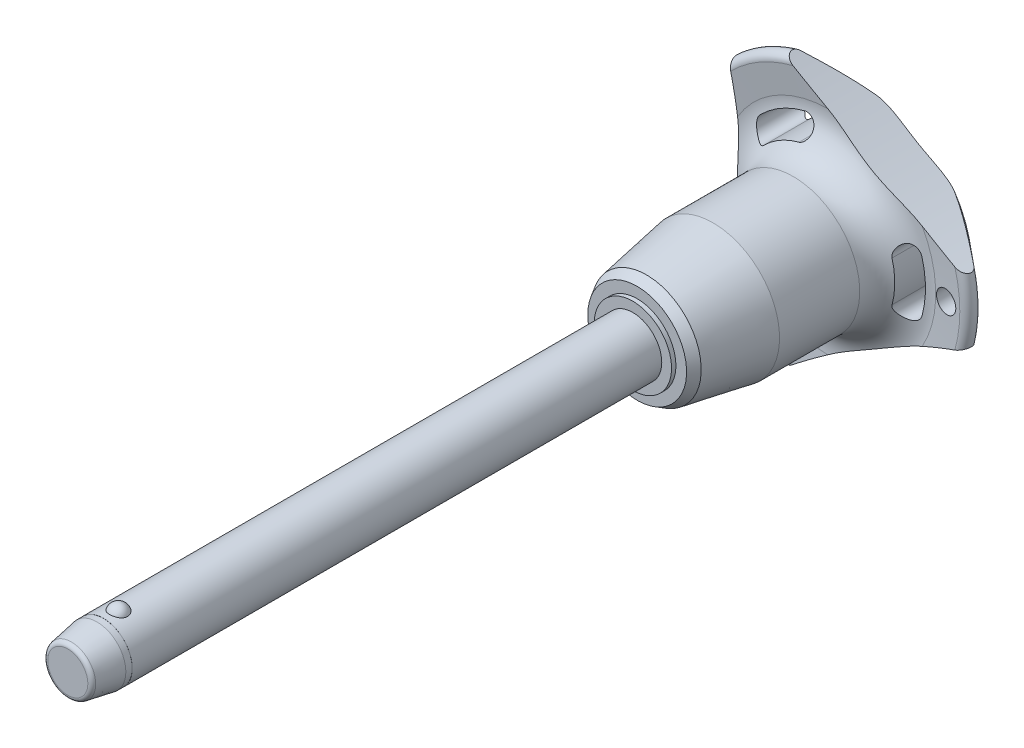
from build123d import *

# Parameters (mm, degrees)
SKETCH1_R           = 4
BOSS_EXTRUDE1_DEPTH = 70
SKETCH2_R           = 3.4
BOSS_EXTRUDE2_DEPTH = 33.3
BOSS_EXTRUDE3_START = 8.2
SKETCH1_2_R         = 4
BOSS_EXTRUDE3_DEPTH = 8.2
CHAMFER1_SIZE       = 4.1
CHAMFER1_SIZE2      = 0.722940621
FILLET1_R           = 0.6
SKETCH6_R           = 102.8
CUT_EXTRUDE1_DEPTH  = 107.957722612
CIRPATTERN1_COUNT   = 3
SKETCH7_R           = 1.5
CUT_EXTRUDE2_DEPTH  = 107.806398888
SKETCH8_R           = 4
SKETCH8_R_2         = 3.99
CUT_EXTRUDE3_DEPTH  = 4.92


with BuildPart() as part:
    # Sketch1 → Boss-Extrude1 (new body)
    with BuildSketch(Plane.XY):
        Circle(SKETCH1_R)
    extrude(amount=-BOSS_EXTRUDE1_DEPTH)

    # Sketch2 → Boss-Extrude2 (add)
    with BuildSketch(Plane(origin=(0, 0, -70), x_dir=(-1, 0, 0), z_dir=(0, 0, -1))):
        Circle(SKETCH2_R)
    extrude(amount=BOSS_EXTRUDE2_DEPTH)

    # Sketch3 → Revolve1 (revolve)
    with BuildSketch(Plane(origin=(0, 0, 0), x_dir=(0, 0, -1), z_dir=(1, 0, 0))):
        with BuildLine():
            Line((-1.2, 4.8), (-1.2, 2.2))
            ThreePointArc((-1.2, 2.2), (0.1, 3.5), (-1.2, 4.8))
        make_face()
        with BuildLine():
            Line((-1.2, -2.2), (-1.2, -4.8))
            ThreePointArc((-1.2, -4.8), (0.1, -3.5), (-1.2, -2.2))
        make_face()
    revolve(axis=Axis((0, -2.2, 1.2), (0, 1, 0)))

    # Sketch1_2 → Boss-Extrude3 (add)
    with BuildSketch(Plane.XY.offset(BOSS_EXTRUDE3_START)):
        Circle(SKETCH1_2_R)
    extrude(amount=-BOSS_EXTRUDE3_DEPTH)

    # Chamfer1
    chamfer1_edges = [part.edges().sort_by_distance(p)[0] for p in [
        (-4, 0, 8.2),
    ]]
    chamfer1_side = [part.faces().sort_by_distance(p)[0] for p in [
        (-4, 0, -30.9),
    ]]
    chamfer(chamfer1_edges, length=CHAMFER1_SIZE, length2=CHAMFER1_SIZE2, reference=chamfer1_side[0])

    # Fillet1
    fillet1_edges = [part.edges().sort_by_distance(p)[0] for p in [
        (-3.277059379, 0, 8.2),
        (3.4, 0, -103.3),
    ]]
    fillet(fillet1_edges, radius=FILLET1_R)

    # Sketch4 → Revolve2 (revolve)
    with BuildSketch(Plane(origin=(0, 0, 0), x_dir=(0, 0, -1), z_dir=(1, 0, 0)), mode=Mode.PRIVATE) as revolve2_sk:
        Polygon((70, 0), (70, 5.353660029), (70.6, 5.353660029), (70.6, 6.834334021), (71.882301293, 7.574671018), (81.1, 9.2), (92.2, 9.2), (92.2, 0), align=None)
    revolve(revolve2_sk.sketch.rotate(Axis((0, 0, -92.2), (0, 0, 1)), 90), axis=Axis((0, 0, -92.2), (0, 0, 1)))

    # Sketch5 → Revolve3 (revolve)
    with BuildSketch(Plane(origin=(0, 0, 0), x_dir=(0, 0, -1), z_dir=(1, 0, 0)), mode=Mode.PRIVATE) as revolve3_sk:
        with BuildLine():
            Line((97.169704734, 14.749576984), (96.756059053, 18.490084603))
            ThreePointArc((96.756059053, 18.490084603), (97.35677658, 19.519442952), (98.516044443, 19.24278761))
            Line((98.516044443, 19.24278761), (102.835691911, 14.094832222))
            ThreePointArc((102.835691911, 14.094832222), (103.3, 12.689260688), (102.67067517, 11.349423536))
            ThreePointArc((102.67067517, 11.349423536), (99.033110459, 6.185112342), (97.75, 0))
            Line((97.75, 0), (92.2, 0))
            Line((92.2, 0), (92.2, 9.2))
            ThreePointArc((92.2, 9.2), (95.924774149, 10.864425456), (97.169704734, 14.749576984))
        make_face()
    revolve(revolve3_sk.sketch.rotate(Axis((0, 0, -97.75), (0, 0, 1)), 90), axis=Axis((0, 0, -97.75), (0, 0, 1)))

    # Sketch6 → Cut-Extrude1 (cut, through all)
    with BuildSketch(Plane.XY):
        with Locations((-115.2, 0)):
            Circle(SKETCH6_R)
        with BuildLine():
            ThreePointArc((12.885043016, -3.538869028), (13.362182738, 0), (12.885043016, 3.538869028))
            ThreePointArc((12.885043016, 3.538869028), (11.179749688, 4.509281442), (10.209337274, 2.803988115))
            ThreePointArc((10.209337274, 2.803988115), (10.587394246, 0), (10.209337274, -2.803988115))
            ThreePointArc((10.209337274, -2.803988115), (11.179749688, -4.509281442), (12.885043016, -3.538869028))
        make_face()
    cut_extrude1 = extrude(amount=-CUT_EXTRUDE1_DEPTH, mode=Mode.SUBTRACT)

    # CirPattern1: Cut-Extrude1 ×3 about axis
    cirpattern1_axis = Axis((0, 0, 0), (0, 0, 1))
    for i in range(1, CIRPATTERN1_COUNT):
        add(cut_extrude1.rotate(cirpattern1_axis, i * 360 / CIRPATTERN1_COUNT), mode=Mode.SUBTRACT)

    # Sketch7 → Cut-Extrude2 (cut, through all)
    with BuildSketch(Plane.XY):
        with Locations(Location((16.362182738, 0, 0), (0, 0, 225.449470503))):
            Circle(SKETCH7_R)
    extrude(amount=-CUT_EXTRUDE2_DEPTH, mode=Mode.SUBTRACT)

    # Sketch8 → Cut-Extrude3 (cut)
    with BuildSketch(Plane.XY.offset(8.2)):
        Circle(SKETCH8_R)
        Circle(SKETCH8_R_2, mode=Mode.SUBTRACT)
    extrude(amount=-CUT_EXTRUDE3_DEPTH, mode=Mode.SUBTRACT)


solid = part.part
